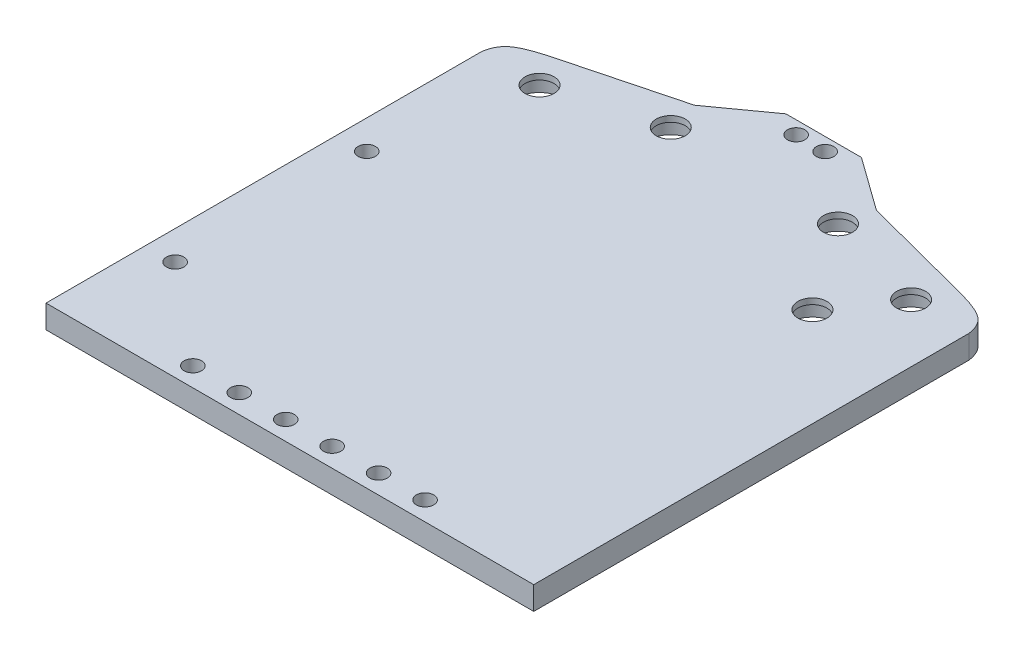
from build123d import *

# Parameters (mm, degrees)
SKETCH1_R           = 2.5
BOSS_EXTRUDE1_DEPTH = 4
SKETCH1_5_R         = 4.1
SKETCH1_5_R_2       = 2.5
CUT_EXTRUDE1_DEPTH  = 3
SKETCH3_R           = 1.500834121
CUT_EXTRUDE6_DEPTH  = 91.443352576
SKETCH7_R           = 1.5
CUT_EXTRUDE5_DEPTH  = 10
SKETCH9_R           = 1.5
CUT_EXTRUDE10_DEPTH = 10


with BuildPart() as part:
    # Sketch1 → Boss-Extrude1 (new body)
    with BuildSketch(Plane(origin=(0, 0, 0), x_dir=(1, 0, 0), z_dir=(0, 1, 0))):
        with BuildLine():
            Line((6.501663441, 11.940329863), (0, 11.940329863))
            Line((0, 11.940329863), (-6.501663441, 11.940329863))
            Line((-6.501663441, 11.940329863), (-15.667494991, 5.351958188))
            Line((-15.667494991, 5.351958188), (-32, 1.082267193))
            add(Edge.make_bspline(
                [(-32, 1.082267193), (-34.479638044, 0.458520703), (-39.744583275, -0.833673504), (-41.650365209, -2.841673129), (-42, -5)],
                knots=[0, 0, 0, 0, 0.499397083, 1, 1, 1, 1], degree=3))
            Line((-42, -5), (-42, -80))
            Line((-42, -80), (42, -80))
            Line((42, -80), (42, -5))
            add(Edge.make_bspline(
                [(32, 1.082267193), (34.479638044, 0.458520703), (39.744583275, -0.833673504), (41.650365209, -2.841673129), (42, -5)],
                knots=[0, 0, 0, 0, 0.499397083, 1, 1, 1, 1], degree=3))
            Line((32, 1.082267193), (15.913913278, 5.287538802))
            ThreePointArc((15.913913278, 5.287538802), (15.791077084, 5.321175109), (15.667494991, 5.351958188))
            Line((15.667494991, 5.351958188), (6.501663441, 11.940329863))
        make_face()
        with Locations(Location((25, -15, 0), (0, 0, 270))):
            Circle(SKETCH1_R, mode=Mode.SUBTRACT)
        with Locations(Location((-32, -5, 0), (0, 0, 270))):
            Circle(SKETCH1_R, mode=Mode.SUBTRACT)
        with Locations(Location((-14.4, 0, 0), (0, 0, 270))):
            Circle(SKETCH1_R, mode=Mode.SUBTRACT)
        with Locations(Location((32, -5, 0), (0, 0, 270))):
            Circle(SKETCH1_R, mode=Mode.SUBTRACT)
        with Locations(Location((14.4, 0, 0), (0, 0, 90))):
            Circle(SKETCH1_R, mode=Mode.SUBTRACT)
    extrude(amount=BOSS_EXTRUDE1_DEPTH)

    # Sketch1_5 → Cut-Extrude1 (cut)
    # profile 1 of 5: a face of its own
    with BuildSketch(Plane(origin=(0, 0, 0), x_dir=(1, 0, 0), z_dir=(0, 1, 0))):
        with Locations(Location((25, -15, 0), (0, 0, 270))):
            Circle(SKETCH1_5_R)
        with Locations(Location((25, -15, 0), (0, 0, 270))):
            Circle(SKETCH1_5_R_2, mode=Mode.SUBTRACT)
    # profile 2 of 5: a face of its own
    with BuildSketch(Plane(origin=(0, 0, 0), x_dir=(1, 0, 0), z_dir=(0, 1, 0))):
        with Locations(Location((-32, -5, 0), (0, 0, 270))):
            Circle(SKETCH1_5_R)
        with Locations(Location((-32, -5, 0), (0, 0, 270))):
            Circle(SKETCH1_5_R_2, mode=Mode.SUBTRACT)
    # profile 3 of 5: a face of its own
    with BuildSketch(Plane(origin=(0, 0, 0), x_dir=(1, 0, 0), z_dir=(0, 1, 0))):
        with Locations(Location((32, -5, 0), (0, 0, 270))):
            Circle(SKETCH1_5_R)
        with Locations(Location((32, -5, 0), (0, 0, 270))):
            Circle(SKETCH1_5_R_2, mode=Mode.SUBTRACT)
    # profile 4 of 5: a face of its own
    with BuildSketch(Plane(origin=(0, 0, 0), x_dir=(1, 0, 0), z_dir=(0, 1, 0))):
        with Locations(Location((-14.4, 0, 0), (0, 0, 270))):
            Circle(SKETCH1_5_R)
        with Locations(Location((-14.4, 0, 0), (0, 0, 270))):
            Circle(SKETCH1_5_R_2, mode=Mode.SUBTRACT)
    # profile 5 of 5: a face of its own
    with BuildSketch(Plane(origin=(0, 0, 0), x_dir=(1, 0, 0), z_dir=(0, 1, 0))):
        with Locations(Location((14.4, 0, 0), (0, 0, 90))):
            Circle(SKETCH1_5_R)
        with Locations(Location((14.4, 0, 0), (0, 0, 90))):
            Circle(SKETCH1_5_R_2, mode=Mode.SUBTRACT)
    extrude(amount=CUT_EXTRUDE1_DEPTH, mode=Mode.SUBTRACT)

    # Sketch3 → Cut-Extrude6 (cut, through all)
    with BuildSketch(Plane(origin=(0, 4, 0), x_dir=(1, 0, 0), z_dir=(0, 1, 0))):
        with Locations(Location((-2.5, 9.690329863, 0), (0, 0, 270))):
            Circle(SKETCH3_R)
        with Locations(Location((2.5, 9.690329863, 0), (0, 0, 270))):
            Circle(SKETCH3_R)
    extrude(amount=-CUT_EXTRUDE6_DEPTH, mode=Mode.SUBTRACT)

    # Sketch7 → Cut-Extrude5 (cut)
    with BuildSketch(Plane.XZ):
        with Locations(Location((-4, 76.716650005, 0), (0, 0, 270))):
            Circle(SKETCH7_R)
        with Locations(Location((4, 76.716650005, 0), (0, 0, 270))):
            Circle(SKETCH7_R)
        with Locations(Location((-20, 76.716650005, 0), (0, 0, 270))):
            Circle(SKETCH7_R)
        with Locations(Location((-12, 76.716650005, 0), (0, 0, 270))):
            Circle(SKETCH7_R)
        with Locations(Location((12, 76.716650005, 0), (0, 0, 90))):
            Circle(SKETCH7_R)
        with Locations(Location((20, 76.716650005, 0), (0, 0, 90))):
            Circle(SKETCH7_R)
    extrude(amount=-CUT_EXTRUDE5_DEPTH, mode=Mode.SUBTRACT)

    # Sketch9 → Cut-Extrude10 (cut)
    with BuildSketch(Plane.XZ):
        with Locations(Location((-37, 29.76, 0), (0, 0, 270))):
            Circle(SKETCH9_R)
        with Locations(Location((-37, 62.76, 0), (0, 0, 270))):
            Circle(SKETCH9_R)
    extrude(amount=-CUT_EXTRUDE10_DEPTH, mode=Mode.SUBTRACT)


solid = part.part
